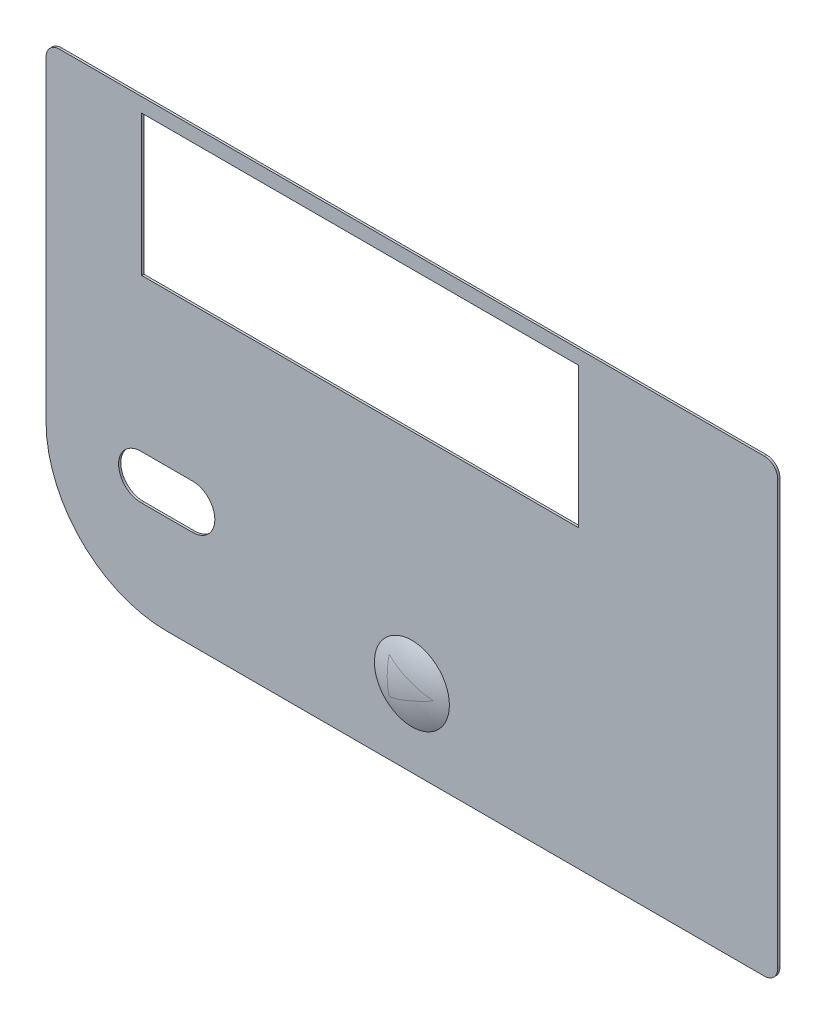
ISO-10303-21;
HEADER;
FILE_DESCRIPTION(('STEP AP214'),'2;1');
FILE_NAME('part.step','',(''),(''),'','','');
FILE_SCHEMA(('AUTOMOTIVE_DESIGN { 1 0 10303 214 1 1 1 1 }'));
ENDSEC;
DATA;
#1=APPLICATION_CONTEXT('core data for automotive mechanical design processes');
#2=APPLICATION_PROTOCOL_DEFINITION('international standard','automotive_design',2000,#1);
#3=PRODUCT_CONTEXT('',#1,'mechanical');
#4=PRODUCT('Part','Part','',(#3));
#5=PRODUCT_RELATED_PRODUCT_CATEGORY('part','',(#4));
#6=PRODUCT_DEFINITION_FORMATION('','',#4);
#7=PRODUCT_DEFINITION_CONTEXT('part definition',#1,'design');
#8=PRODUCT_DEFINITION('design','',#6,#7);
#9=PRODUCT_DEFINITION_SHAPE('','',#8);
#10=(LENGTH_UNIT() NAMED_UNIT(*) SI_UNIT(.MILLI.,.METRE.));
#11=(NAMED_UNIT(*) PLANE_ANGLE_UNIT() SI_UNIT($,.RADIAN.));
#12=(NAMED_UNIT(*) SI_UNIT($,.STERADIAN.) SOLID_ANGLE_UNIT());
#13=UNCERTAINTY_MEASURE_WITH_UNIT(LENGTH_MEASURE(1.E-05),#10,'distance_accuracy_value','');
#14=(GEOMETRIC_REPRESENTATION_CONTEXT(3) GLOBAL_UNCERTAINTY_ASSIGNED_CONTEXT((#13)) GLOBAL_UNIT_ASSIGNED_CONTEXT((#10,
#11,#12)) REPRESENTATION_CONTEXT('',''));
#15=CARTESIAN_POINT('',(0.,0.,0.));
#16=DIRECTION('',(0.,0.,1.));
#17=DIRECTION('',(1.,0.,0.));
#18=AXIS2_PLACEMENT_3D('',#15,#16,#17);
#19=CARTESIAN_POINT('',(0.,-20.,-11.2087121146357));
#20=DIRECTION('',(0.,0.,-1.));
#21=DIRECTION('',(0.,1.,0.));
#22=AXIS2_PLACEMENT_3D('',#19,#20,#21);
#23=SPHERICAL_SURFACE('',#22,12.);
#24=CARTESIAN_POINT('',(0.,-20.,-0.299999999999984));
#25=DIRECTION('',(0.,0.,-1.));
#26=DIRECTION('',(0.,1.,0.));
#27=AXIS2_PLACEMENT_3D('',#24,#25,#26);
#28=CIRCLE('',#27,5.);
#29=CARTESIAN_POINT('',(0.,-15.,-0.3));
#30=VERTEX_POINT('',#29);
#31=EDGE_CURVE('E11',#30,#30,#28,.T.);
#32=ORIENTED_EDGE('',*,*,#31,.F.);
#33=EDGE_LOOP('',(#32));
#34=FACE_BOUND('',#33,.T.);
#35=ADVANCED_FACE('F45',(#34),#23,.T.);
#36=CARTESIAN_POINT('',(0.,-15.,-0.300000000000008));
#37=DIRECTION('',(0.,0.,-1.));
#38=DIRECTION('',(0.,1.,0.));
#39=AXIS2_PLACEMENT_3D('',#36,#37,#38);
#40=PLANE('',#39);
#41=ORIENTED_EDGE('',*,*,#31,.T.);
#42=EDGE_LOOP('',(#41));
#43=FACE_BOUND('',#42,.T.);
#44=ADVANCED_FACE('F52',(#43),#40,.T.);
#45=CLOSED_SHELL('',(#35,#44));
#46=MANIFOLD_SOLID_BREP('B2_NOT_SHOWN',#45);
#47=CARTESIAN_POINT('',(0.,-20.,-11.2087121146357));
#48=DIRECTION('',(0.,0.,-1.));
#49=DIRECTION('',(0.,1.,0.));
#50=AXIS2_PLACEMENT_3D('',#47,#48,#49);
#51=SPHERICAL_SURFACE('',#50,12.3);
#52=CARTESIAN_POINT('',(0.,-20.,0.));
#53=DIRECTION('',(0.,0.,1.));
#54=DIRECTION('',(1.,0.,0.));
#55=AXIS2_PLACEMENT_3D('',#52,#53,#54);
#56=CIRCLE('',#55,5.06505406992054);
#57=CARTESIAN_POINT('',(5.06505406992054,-20.,0.));
#58=VERTEX_POINT('',#57);
#59=EDGE_CURVE('E327',#58,#58,#56,.T.);
#60=ORIENTED_EDGE('',*,*,#59,.T.);
#61=EDGE_LOOP('',(#60));
#62=FACE_BOUND('',#61,.T.);
#63=CARTESIAN_POINT('',(0.512563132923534,-18.7625631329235,-11.2087121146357));
#64=DIRECTION('',(-0.382683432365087,-0.923879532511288,0.));
#65=DIRECTION('',(0.923879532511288,-0.382683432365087,0.));
#66=AXIS2_PLACEMENT_3D('',#63,#64,#65);
#67=CIRCLE('',#66,12.2268568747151);
#68=CARTESIAN_POINT('',(-2.5,-17.5147186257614,0.575318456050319));
#69=VERTEX_POINT('',#68);
#70=CARTESIAN_POINT('',(3.5,-20.,0.582810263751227));
#71=VERTEX_POINT('',#70);
#72=EDGE_CURVE('E80',#69,#71,#67,.F.);
#73=ORIENTED_EDGE('',*,*,#72,.T.);
#74=CARTESIAN_POINT('',(0.512563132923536,-21.2374368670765,-11.2087121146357));
#75=DIRECTION('',(-0.382683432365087,0.923879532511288,0.));
#76=DIRECTION('',(-0.923879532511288,-0.382683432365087,0.));
#77=AXIS2_PLACEMENT_3D('',#74,#75,#76);
#78=CIRCLE('',#77,12.2268568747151);
#79=CARTESIAN_POINT('',(-2.5,-22.4852813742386,0.575318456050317));
#80=VERTEX_POINT('',#79);
#81=EDGE_CURVE('E43',#71,#80,#78,.F.);
#82=ORIENTED_EDGE('',*,*,#81,.T.);
#83=CARTESIAN_POINT('',(-2.5,-20.,-11.2087121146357));
#84=DIRECTION('',(1.,0.,0.));
#85=DIRECTION('',(0.,1.,0.));
#86=AXIS2_PLACEMENT_3D('',#83,#84,#85);
#87=CIRCLE('',#86,12.0432553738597);
#88=EDGE_CURVE('E330',#80,#69,#87,.F.);
#89=ORIENTED_EDGE('',*,*,#88,.T.);
#90=EDGE_LOOP('',(#73,#82,#89));
#91=FACE_BOUND('',#90,.T.);
#92=ADVANCED_FACE('F71',(#62,#91),#51,.T.);
#93=CARTESIAN_POINT('',(-47.625,28.625,-0.3));
#94=DIRECTION('',(0.,0.,1.));
#95=DIRECTION('',(1.,0.,0.));
#96=AXIS2_PLACEMENT_3D('',#93,#94,#95);
#97=PLANE('',#96);
#98=CARTESIAN_POINT('',(-47.625,28.625,-0.3));
#99=DIRECTION('',(0.,0.,1.));
#100=DIRECTION('',(1.,0.,0.));
#101=AXIS2_PLACEMENT_3D('',#98,#99,#100);
#102=CIRCLE('',#101,1.8);
#103=CARTESIAN_POINT('',(-47.625,30.425,-0.3));
#104=VERTEX_POINT('',#103);
#105=CARTESIAN_POINT('',(-49.425,28.625,-0.3));
#106=VERTEX_POINT('',#105);
#107=EDGE_CURVE('E257',#104,#106,#102,.T.);
#108=ORIENTED_EDGE('',*,*,#107,.F.);
#109=DIRECTION('',(-1.,0.,0.));
#110=VECTOR('',#109,1.);
#111=CARTESIAN_POINT('',(-47.625,30.425,-0.3));
#112=LINE('',#111,#110);
#113=CARTESIAN_POINT('',(47.625,30.425,-0.3));
#114=VERTEX_POINT('',#113);
#115=EDGE_CURVE('E279',#114,#104,#112,.T.);
#116=ORIENTED_EDGE('',*,*,#115,.F.);
#117=CARTESIAN_POINT('',(47.625,28.625,-0.3));
#118=DIRECTION('',(0.,0.,1.));
#119=DIRECTION('',(-1.,0.,0.));
#120=AXIS2_PLACEMENT_3D('',#117,#118,#119);
#121=CIRCLE('',#120,1.8);
#122=CARTESIAN_POINT('',(49.425,28.625,-0.3));
#123=VERTEX_POINT('',#122);
#124=EDGE_CURVE('E276',#123,#114,#121,.T.);
#125=ORIENTED_EDGE('',*,*,#124,.F.);
#126=DIRECTION('',(0.,1.,0.));
#127=VECTOR('',#126,1.);
#128=CARTESIAN_POINT('',(49.425,28.625,-0.3));
#129=LINE('',#128,#127);
#130=CARTESIAN_POINT('',(49.425,-28.625,-0.3));
#131=VERTEX_POINT('',#130);
#132=EDGE_CURVE('E273',#131,#123,#129,.T.);
#133=ORIENTED_EDGE('',*,*,#132,.F.);
#134=CARTESIAN_POINT('',(47.625,-28.625,-0.3));
#135=DIRECTION('',(0.,0.,1.));
#136=DIRECTION('',(1.,0.,0.));
#137=AXIS2_PLACEMENT_3D('',#134,#135,#136);
#138=CIRCLE('',#137,1.8);
#139=CARTESIAN_POINT('',(47.625,-30.425,-0.3));
#140=VERTEX_POINT('',#139);
#141=EDGE_CURVE('E270',#140,#131,#138,.T.);
#142=ORIENTED_EDGE('',*,*,#141,.F.);
#143=DIRECTION('',(1.,0.,0.));
#144=VECTOR('',#143,1.);
#145=CARTESIAN_POINT('',(-33.125,-30.425,-0.3));
#146=LINE('',#145,#144);
#147=CARTESIAN_POINT('',(-33.125,-30.425,-0.3));
#148=VERTEX_POINT('',#147);
#149=EDGE_CURVE('E267',#148,#140,#146,.T.);
#150=ORIENTED_EDGE('',*,*,#149,.F.);
#151=CARTESIAN_POINT('',(-33.125,-14.125,-0.3));
#152=DIRECTION('',(0.,0.,1.));
#153=DIRECTION('',(1.,0.,0.));
#154=AXIS2_PLACEMENT_3D('',#151,#152,#153);
#155=CIRCLE('',#154,16.3);
#156=CARTESIAN_POINT('',(-49.425,-14.125,-0.3));
#157=VERTEX_POINT('',#156);
#158=EDGE_CURVE('E264',#157,#148,#155,.T.);
#159=ORIENTED_EDGE('',*,*,#158,.F.);
#160=DIRECTION('',(0.,-1.,0.));
#161=VECTOR('',#160,1.);
#162=CARTESIAN_POINT('',(-49.425,28.625,-0.3));
#163=LINE('',#162,#161);
#164=EDGE_CURVE('E260',#106,#157,#163,.T.);
#165=ORIENTED_EDGE('',*,*,#164,.F.);
#166=EDGE_LOOP('',(#108,#116,#125,#133,#142,#150,#159,#165));
#167=FACE_BOUND('',#166,.T.);
#168=DIRECTION('',(-1.,0.,0.));
#169=VECTOR('',#168,1.);
#170=CARTESIAN_POINT('',(-47.625,-11.1247769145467,-0.3));
#171=LINE('',#170,#169);
#172=CARTESIAN_POINT('',(-29.6250000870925,-11.1247769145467,-0.3));
#173=VERTEX_POINT('',#172);
#174=CARTESIAN_POINT('',(-36.6249999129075,-11.1247769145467,-0.3));
#175=VERTEX_POINT('',#174);
#176=EDGE_CURVE('E250',#173,#175,#171,.T.);
#177=ORIENTED_EDGE('',*,*,#176,.T.);
#178=CARTESIAN_POINT('',(-36.6249999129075,-14.1263385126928,-0.3));
#179=DIRECTION('',(0.,0.,1.));
#180=DIRECTION('',(1.,0.,0.));
#181=AXIS2_PLACEMENT_3D('',#178,#179,#180);
#182=CIRCLE('',#181,3.00156159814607);
#183=CARTESIAN_POINT('',(-36.4881087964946,-17.1247769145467,-0.3));
#184=VERTEX_POINT('',#183);
#185=EDGE_CURVE('E253',#175,#184,#182,.T.);
#186=ORIENTED_EDGE('',*,*,#185,.T.);
#187=DIRECTION('',(1.,0.,0.));
#188=VECTOR('',#187,1.);
#189=CARTESIAN_POINT('',(-47.625,-17.1247769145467,-0.3));
#190=LINE('',#189,#188);
#191=CARTESIAN_POINT('',(-29.6250000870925,-17.1247769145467,-0.3));
#192=VERTEX_POINT('',#191);
#193=EDGE_CURVE('E238',#184,#192,#190,.T.);
#194=ORIENTED_EDGE('',*,*,#193,.T.);
#195=CARTESIAN_POINT('',(-29.6250000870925,-14.1247769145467,-0.3));
#196=DIRECTION('',(0.,0.,1.));
#197=DIRECTION('',(1.,0.,0.));
#198=AXIS2_PLACEMENT_3D('',#195,#196,#197);
#199=CIRCLE('',#198,3.);
#200=EDGE_CURVE('E247',#192,#173,#199,.T.);
#201=ORIENTED_EDGE('',*,*,#200,.T.);
#202=EDGE_LOOP('',(#177,#186,#194,#201));
#203=FACE_BOUND('',#202,.T.);
#204=DIRECTION('',(0.,1.,0.));
#205=VECTOR('',#204,1.);
#206=CARTESIAN_POINT('',(-36.5,28.5,-0.3));
#207=LINE('',#206,#205);
#208=CARTESIAN_POINT('',(-36.5,9.50000000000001,-0.3));
#209=VERTEX_POINT('',#208);
#210=CARTESIAN_POINT('',(-36.5,28.5,-0.3));
#211=VERTEX_POINT('',#210);
#212=EDGE_CURVE('E205',#209,#211,#207,.T.);
#213=ORIENTED_EDGE('',*,*,#212,.F.);
#214=DIRECTION('',(-1.,0.,0.));
#215=VECTOR('',#214,1.);
#216=CARTESIAN_POINT('',(-36.5,9.5,-0.3));
#217=LINE('',#216,#215);
#218=CARTESIAN_POINT('',(22.5,9.5,-0.3));
#219=VERTEX_POINT('',#218);
#220=EDGE_CURVE('E210',#219,#209,#217,.T.);
#221=ORIENTED_EDGE('',*,*,#220,.F.);
#222=DIRECTION('',(0.,-1.,0.));
#223=VECTOR('',#222,1.);
#224=CARTESIAN_POINT('',(22.5,9.5,-0.3));
#225=LINE('',#224,#223);
#226=CARTESIAN_POINT('',(22.5,28.5,-0.3));
#227=VERTEX_POINT('',#226);
#228=EDGE_CURVE('E215',#227,#219,#225,.T.);
#229=ORIENTED_EDGE('',*,*,#228,.F.);
#230=DIRECTION('',(1.,0.,0.));
#231=VECTOR('',#230,1.);
#232=CARTESIAN_POINT('',(22.5,28.5,-0.3));
#233=LINE('',#232,#231);
#234=EDGE_CURVE('E194',#211,#227,#233,.T.);
#235=ORIENTED_EDGE('',*,*,#234,.F.);
#236=EDGE_LOOP('',(#213,#221,#229,#235));
#237=FACE_BOUND('',#236,.T.);
#238=CARTESIAN_POINT('',(0.,-20.,-0.299999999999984));
#239=DIRECTION('',(0.,0.,-1.));
#240=DIRECTION('',(0.,1.,0.));
#241=AXIS2_PLACEMENT_3D('',#238,#239,#240);
#242=CIRCLE('',#241,5.);
#243=CARTESIAN_POINT('',(0.,-15.,-0.3));
#244=VERTEX_POINT('',#243);
#245=EDGE_CURVE('E568',#244,#244,#242,.T.);
#246=ORIENTED_EDGE('',*,*,#245,.F.);
#247=EDGE_LOOP('',(#246));
#248=FACE_BOUND('',#247,.T.);
#249=ADVANCED_FACE('F212',(#167,#203,#237,#248),#97,.F.);
#250=CARTESIAN_POINT('',(-47.625,28.625,-0.3));
#251=DIRECTION('',(0.,0.,1.));
#252=DIRECTION('',(1.,0.,0.));
#253=AXIS2_PLACEMENT_3D('',#250,#251,#252);
#254=CYLINDRICAL_SURFACE('',#253,1.8);
#255=CARTESIAN_POINT('',(-47.625,28.625,0.));
#256=DIRECTION('',(0.,0.,1.));
#257=DIRECTION('',(1.,0.,0.));
#258=AXIS2_PLACEMENT_3D('',#255,#256,#257);
#259=CIRCLE('',#258,1.8);
#260=CARTESIAN_POINT('',(-47.625,30.425,0.));
#261=VERTEX_POINT('',#260);
#262=CARTESIAN_POINT('',(-49.425,28.625,0.));
#263=VERTEX_POINT('',#262);
#264=EDGE_CURVE('E256',#261,#263,#259,.T.);
#265=ORIENTED_EDGE('',*,*,#264,.F.);
#266=DIRECTION('',(0.,0.,1.));
#267=VECTOR('',#266,1.);
#268=CARTESIAN_POINT('',(-47.625,30.425,-0.3));
#269=LINE('',#268,#267);
#270=EDGE_CURVE('E305',#104,#261,#269,.T.);
#271=ORIENTED_EDGE('',*,*,#270,.F.);
#272=ORIENTED_EDGE('',*,*,#107,.T.);
#273=DIRECTION('',(0.,0.,1.));
#274=VECTOR('',#273,1.);
#275=CARTESIAN_POINT('',(-49.425,28.625,-0.3));
#276=LINE('',#275,#274);
#277=EDGE_CURVE('E282',#106,#263,#276,.T.);
#278=ORIENTED_EDGE('',*,*,#277,.T.);
#279=EDGE_LOOP('',(#265,#271,#272,#278));
#280=FACE_BOUND('',#279,.T.);
#281=ADVANCED_FACE('F73',(#280),#254,.T.);
#282=CARTESIAN_POINT('',(-47.625,30.425,-0.3));
#283=DIRECTION('',(0.,1.,0.));
#284=DIRECTION('',(0.,0.,1.));
#285=AXIS2_PLACEMENT_3D('',#282,#283,#284);
#286=PLANE('',#285);
#287=DIRECTION('',(-1.,0.,0.));
#288=VECTOR('',#287,1.);
#289=CARTESIAN_POINT('',(-47.625,30.425,0.));
#290=LINE('',#289,#288);
#291=CARTESIAN_POINT('',(47.625,30.425,0.));
#292=VERTEX_POINT('',#291);
#293=EDGE_CURVE('E261',#292,#261,#290,.T.);
#294=ORIENTED_EDGE('',*,*,#293,.F.);
#295=DIRECTION('',(0.,0.,1.));
#296=VECTOR('',#295,1.);
#297=CARTESIAN_POINT('',(47.625,30.425,-0.3));
#298=LINE('',#297,#296);
#299=EDGE_CURVE('E308',#114,#292,#298,.T.);
#300=ORIENTED_EDGE('',*,*,#299,.F.);
#301=ORIENTED_EDGE('',*,*,#115,.T.);
#302=ORIENTED_EDGE('',*,*,#270,.T.);
#303=EDGE_LOOP('',(#294,#300,#301,#302));
#304=FACE_BOUND('',#303,.T.);
#305=ADVANCED_FACE('F396',(#304),#286,.T.);
#306=CARTESIAN_POINT('',(47.625,28.625,-0.3));
#307=DIRECTION('',(0.,0.,1.));
#308=DIRECTION('',(1.,0.,0.));
#309=AXIS2_PLACEMENT_3D('',#306,#307,#308);
#310=CYLINDRICAL_SURFACE('',#309,1.8);
#311=CARTESIAN_POINT('',(47.625,28.625,0.));
#312=DIRECTION('',(0.,0.,1.));
#313=DIRECTION('',(-1.,0.,0.));
#314=AXIS2_PLACEMENT_3D('',#311,#312,#313);
#315=CIRCLE('',#314,1.8);
#316=CARTESIAN_POINT('',(49.425,28.625,0.));
#317=VERTEX_POINT('',#316);
#318=EDGE_CURVE('E300',#317,#292,#315,.T.);
#319=ORIENTED_EDGE('',*,*,#318,.F.);
#320=DIRECTION('',(0.,0.,1.));
#321=VECTOR('',#320,1.);
#322=CARTESIAN_POINT('',(49.425,28.625,-0.3));
#323=LINE('',#322,#321);
#324=EDGE_CURVE('E310',#123,#317,#323,.T.);
#325=ORIENTED_EDGE('',*,*,#324,.F.);
#326=ORIENTED_EDGE('',*,*,#124,.T.);
#327=ORIENTED_EDGE('',*,*,#299,.T.);
#328=EDGE_LOOP('',(#319,#325,#326,#327));
#329=FACE_BOUND('',#328,.T.);
#330=ADVANCED_FACE('F400',(#329),#310,.T.);
#331=CARTESIAN_POINT('',(49.425,28.625,-0.3));
#332=DIRECTION('',(1.,0.,0.));
#333=DIRECTION('',(0.,0.,-1.));
#334=AXIS2_PLACEMENT_3D('',#331,#332,#333);
#335=PLANE('',#334);
#336=DIRECTION('',(0.,1.,0.));
#337=VECTOR('',#336,1.);
#338=CARTESIAN_POINT('',(49.425,28.625,0.));
#339=LINE('',#338,#337);
#340=CARTESIAN_POINT('',(49.425,-28.625,0.));
#341=VERTEX_POINT('',#340);
#342=EDGE_CURVE('E297',#341,#317,#339,.T.);
#343=ORIENTED_EDGE('',*,*,#342,.F.);
#344=DIRECTION('',(0.,0.,1.));
#345=VECTOR('',#344,1.);
#346=CARTESIAN_POINT('',(49.425,-28.625,-0.3));
#347=LINE('',#346,#345);
#348=EDGE_CURVE('E312',#131,#341,#347,.T.);
#349=ORIENTED_EDGE('',*,*,#348,.F.);
#350=ORIENTED_EDGE('',*,*,#132,.T.);
#351=ORIENTED_EDGE('',*,*,#324,.T.);
#352=EDGE_LOOP('',(#343,#349,#350,#351));
#353=FACE_BOUND('',#352,.T.);
#354=ADVANCED_FACE('F392',(#353),#335,.T.);
#355=CARTESIAN_POINT('',(47.625,-28.625,-0.3));
#356=DIRECTION('',(0.,0.,1.));
#357=DIRECTION('',(1.,0.,0.));
#358=AXIS2_PLACEMENT_3D('',#355,#356,#357);
#359=CYLINDRICAL_SURFACE('',#358,1.8);
#360=CARTESIAN_POINT('',(47.625,-28.625,0.));
#361=DIRECTION('',(0.,0.,1.));
#362=DIRECTION('',(1.,0.,0.));
#363=AXIS2_PLACEMENT_3D('',#360,#361,#362);
#364=CIRCLE('',#363,1.8);
#365=CARTESIAN_POINT('',(47.625,-30.425,0.));
#366=VERTEX_POINT('',#365);
#367=EDGE_CURVE('E294',#366,#341,#364,.T.);
#368=ORIENTED_EDGE('',*,*,#367,.F.);
#369=DIRECTION('',(0.,0.,1.));
#370=VECTOR('',#369,1.);
#371=CARTESIAN_POINT('',(47.625,-30.425,-0.3));
#372=LINE('',#371,#370);
#373=EDGE_CURVE('E314',#140,#366,#372,.T.);
#374=ORIENTED_EDGE('',*,*,#373,.F.);
#375=ORIENTED_EDGE('',*,*,#141,.T.);
#376=ORIENTED_EDGE('',*,*,#348,.T.);
#377=EDGE_LOOP('',(#368,#374,#375,#376));
#378=FACE_BOUND('',#377,.T.);
#379=ADVANCED_FACE('F388',(#378),#359,.T.);
#380=CARTESIAN_POINT('',(-33.125,-30.425,-0.3));
#381=DIRECTION('',(0.,-1.,0.));
#382=DIRECTION('',(0.,0.,-1.));
#383=AXIS2_PLACEMENT_3D('',#380,#381,#382);
#384=PLANE('',#383);
#385=DIRECTION('',(1.,0.,0.));
#386=VECTOR('',#385,1.);
#387=CARTESIAN_POINT('',(-33.125,-30.425,0.));
#388=LINE('',#387,#386);
#389=CARTESIAN_POINT('',(-33.125,-30.425,0.));
#390=VERTEX_POINT('',#389);
#391=EDGE_CURVE('E291',#390,#366,#388,.T.);
#392=ORIENTED_EDGE('',*,*,#391,.F.);
#393=DIRECTION('',(0.,0.,1.));
#394=VECTOR('',#393,1.);
#395=CARTESIAN_POINT('',(-33.125,-30.425,-0.3));
#396=LINE('',#395,#394);
#397=EDGE_CURVE('E316',#148,#390,#396,.T.);
#398=ORIENTED_EDGE('',*,*,#397,.F.);
#399=ORIENTED_EDGE('',*,*,#149,.T.);
#400=ORIENTED_EDGE('',*,*,#373,.T.);
#401=EDGE_LOOP('',(#392,#398,#399,#400));
#402=FACE_BOUND('',#401,.T.);
#403=ADVANCED_FACE('F384',(#402),#384,.T.);
#404=CARTESIAN_POINT('',(-33.125,-14.125,-0.3));
#405=DIRECTION('',(0.,0.,1.));
#406=DIRECTION('',(1.,0.,0.));
#407=AXIS2_PLACEMENT_3D('',#404,#405,#406);
#408=CYLINDRICAL_SURFACE('',#407,16.3);
#409=CARTESIAN_POINT('',(-33.125,-14.125,0.));
#410=DIRECTION('',(0.,0.,1.));
#411=DIRECTION('',(1.,0.,0.));
#412=AXIS2_PLACEMENT_3D('',#409,#410,#411);
#413=CIRCLE('',#412,16.3);
#414=CARTESIAN_POINT('',(-49.425,-14.125,0.));
#415=VERTEX_POINT('',#414);
#416=EDGE_CURVE('E288',#415,#390,#413,.T.);
#417=ORIENTED_EDGE('',*,*,#416,.F.);
#418=DIRECTION('',(0.,0.,1.));
#419=VECTOR('',#418,1.);
#420=CARTESIAN_POINT('',(-49.425,-14.125,-0.3));
#421=LINE('',#420,#419);
#422=EDGE_CURVE('E318',#157,#415,#421,.T.);
#423=ORIENTED_EDGE('',*,*,#422,.F.);
#424=ORIENTED_EDGE('',*,*,#158,.T.);
#425=ORIENTED_EDGE('',*,*,#397,.T.);
#426=EDGE_LOOP('',(#417,#423,#424,#425));
#427=FACE_BOUND('',#426,.T.);
#428=ADVANCED_FACE('F380',(#427),#408,.T.);
#429=CARTESIAN_POINT('',(-49.425,28.625,-0.3));
#430=DIRECTION('',(-1.,0.,0.));
#431=DIRECTION('',(0.,-1.,0.));
#432=AXIS2_PLACEMENT_3D('',#429,#430,#431);
#433=PLANE('',#432);
#434=DIRECTION('',(0.,-1.,0.));
#435=VECTOR('',#434,1.);
#436=CARTESIAN_POINT('',(-49.425,28.625,0.));
#437=LINE('',#436,#435);
#438=EDGE_CURVE('E285',#263,#415,#437,.T.);
#439=ORIENTED_EDGE('',*,*,#438,.F.);
#440=ORIENTED_EDGE('',*,*,#277,.F.);
#441=ORIENTED_EDGE('',*,*,#164,.T.);
#442=ORIENTED_EDGE('',*,*,#422,.T.);
#443=EDGE_LOOP('',(#439,#440,#441,#442));
#444=FACE_BOUND('',#443,.T.);
#445=ADVANCED_FACE('F361',(#444),#433,.T.);
#446=CARTESIAN_POINT('',(-47.625,28.625,0.));
#447=DIRECTION('',(0.,0.,1.));
#448=DIRECTION('',(1.,0.,0.));
#449=AXIS2_PLACEMENT_3D('',#446,#447,#448);
#450=PLANE('',#449);
#451=ORIENTED_EDGE('',*,*,#59,.F.);
#452=EDGE_LOOP('',(#451));
#453=FACE_BOUND('',#452,.T.);
#454=DIRECTION('',(1.,0.,0.));
#455=VECTOR('',#454,1.);
#456=CARTESIAN_POINT('',(-47.625,9.5,0.));
#457=LINE('',#456,#455);
#458=CARTESIAN_POINT('',(-36.5,9.5,0.));
#459=VERTEX_POINT('',#458);
#460=CARTESIAN_POINT('',(22.5,9.5,0.));
#461=VERTEX_POINT('',#460);
#462=EDGE_CURVE('E325',#459,#461,#457,.T.);
#463=ORIENTED_EDGE('',*,*,#462,.F.);
#464=DIRECTION('',(0.,-1.,0.));
#465=VECTOR('',#464,1.);
#466=CARTESIAN_POINT('',(-36.5,28.625,0.));
#467=LINE('',#466,#465);
#468=CARTESIAN_POINT('',(-36.5,28.5,0.));
#469=VERTEX_POINT('',#468);
#470=EDGE_CURVE('E307',#469,#459,#467,.T.);
#471=ORIENTED_EDGE('',*,*,#470,.F.);
#472=DIRECTION('',(-1.,0.,0.));
#473=VECTOR('',#472,1.);
#474=CARTESIAN_POINT('',(-47.625,28.5,0.));
#475=LINE('',#474,#473);
#476=CARTESIAN_POINT('',(22.5,28.5,0.));
#477=VERTEX_POINT('',#476);
#478=EDGE_CURVE('E197',#477,#469,#475,.T.);
#479=ORIENTED_EDGE('',*,*,#478,.F.);
#480=DIRECTION('',(0.,1.,0.));
#481=VECTOR('',#480,1.);
#482=CARTESIAN_POINT('',(22.5,28.625,0.));
#483=LINE('',#482,#481);
#484=EDGE_CURVE('E323',#461,#477,#483,.T.);
#485=ORIENTED_EDGE('',*,*,#484,.F.);
#486=EDGE_LOOP('',(#463,#471,#479,#485));
#487=FACE_BOUND('',#486,.T.);
#488=CARTESIAN_POINT('',(-36.6249999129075,-14.1263385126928,0.));
#489=DIRECTION('',(0.,0.,1.));
#490=DIRECTION('',(1.,0.,0.));
#491=AXIS2_PLACEMENT_3D('',#488,#489,#490);
#492=CIRCLE('',#491,3.00156159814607);
#493=CARTESIAN_POINT('',(-36.6249999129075,-11.1247769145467,0.));
#494=VERTEX_POINT('',#493);
#495=CARTESIAN_POINT('',(-36.4881087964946,-17.1247769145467,0.));
#496=VERTEX_POINT('',#495);
#497=EDGE_CURVE('E222',#494,#496,#492,.T.);
#498=ORIENTED_EDGE('',*,*,#497,.F.);
#499=DIRECTION('',(-1.,0.,0.));
#500=VECTOR('',#499,1.);
#501=CARTESIAN_POINT('',(-36.6249999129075,-11.1247769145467,0.));
#502=LINE('',#501,#500);
#503=CARTESIAN_POINT('',(-29.6250000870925,-11.1247769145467,0.));
#504=VERTEX_POINT('',#503);
#505=EDGE_CURVE('E232',#504,#494,#502,.T.);
#506=ORIENTED_EDGE('',*,*,#505,.F.);
#507=CARTESIAN_POINT('',(-29.6250000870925,-14.1247769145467,0.));
#508=DIRECTION('',(0.,0.,1.));
#509=DIRECTION('',(1.,0.,0.));
#510=AXIS2_PLACEMENT_3D('',#507,#508,#509);
#511=CIRCLE('',#510,3.);
#512=CARTESIAN_POINT('',(-29.6250000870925,-17.1247769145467,0.));
#513=VERTEX_POINT('',#512);
#514=EDGE_CURVE('E229',#513,#504,#511,.T.);
#515=ORIENTED_EDGE('',*,*,#514,.F.);
#516=DIRECTION('',(1.,0.,0.));
#517=VECTOR('',#516,1.);
#518=CARTESIAN_POINT('',(-36.4881087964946,-17.1247769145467,0.));
#519=LINE('',#518,#517);
#520=EDGE_CURVE('E226',#496,#513,#519,.T.);
#521=ORIENTED_EDGE('',*,*,#520,.F.);
#522=EDGE_LOOP('',(#498,#506,#515,#521));
#523=FACE_BOUND('',#522,.T.);
#524=ORIENTED_EDGE('',*,*,#264,.T.);
#525=ORIENTED_EDGE('',*,*,#438,.T.);
#526=ORIENTED_EDGE('',*,*,#416,.T.);
#527=ORIENTED_EDGE('',*,*,#391,.T.);
#528=ORIENTED_EDGE('',*,*,#367,.T.);
#529=ORIENTED_EDGE('',*,*,#342,.T.);
#530=ORIENTED_EDGE('',*,*,#318,.T.);
#531=ORIENTED_EDGE('',*,*,#293,.T.);
#532=EDGE_LOOP('',(#524,#525,#526,#527,#528,#529,#530,#531));
#533=FACE_BOUND('',#532,.T.);
#534=ADVANCED_FACE('F357',(#453,#487,#523,#533),#450,.T.);
#535=CARTESIAN_POINT('',(-36.6249999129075,-14.1263385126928,-10.));
#536=DIRECTION('',(0.,0.,1.));
#537=DIRECTION('',(1.,0.,0.));
#538=AXIS2_PLACEMENT_3D('',#535,#536,#537);
#539=CYLINDRICAL_SURFACE('',#538,3.00156159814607);
#540=DIRECTION('',(0.,0.,1.));
#541=VECTOR('',#540,1.);
#542=CARTESIAN_POINT('',(-36.6249999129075,-11.1247769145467,-10.));
#543=LINE('',#542,#541);
#544=EDGE_CURVE('E236',#175,#494,#543,.T.);
#545=ORIENTED_EDGE('',*,*,#544,.T.);
#546=ORIENTED_EDGE('',*,*,#497,.T.);
#547=DIRECTION('',(0.,0.,1.));
#548=VECTOR('',#547,1.);
#549=CARTESIAN_POINT('',(-36.4881087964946,-17.1247769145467,-10.));
#550=LINE('',#549,#548);
#551=EDGE_CURVE('E235',#184,#496,#550,.T.);
#552=ORIENTED_EDGE('',*,*,#551,.F.);
#553=ORIENTED_EDGE('',*,*,#185,.F.);
#554=EDGE_LOOP('',(#545,#546,#552,#553));
#555=FACE_BOUND('',#554,.T.);
#556=ADVANCED_FACE('F360',(#555),#539,.F.);
#557=CARTESIAN_POINT('',(-36.6249999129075,-11.1247769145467,-10.));
#558=DIRECTION('',(0.,1.,0.));
#559=DIRECTION('',(0.,0.,1.));
#560=AXIS2_PLACEMENT_3D('',#557,#558,#559);
#561=PLANE('',#560);
#562=DIRECTION('',(0.,0.,1.));
#563=VECTOR('',#562,1.);
#564=CARTESIAN_POINT('',(-29.6250000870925,-11.1247769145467,-10.));
#565=LINE('',#564,#563);
#566=EDGE_CURVE('E239',#173,#504,#565,.T.);
#567=ORIENTED_EDGE('',*,*,#566,.T.);
#568=ORIENTED_EDGE('',*,*,#505,.T.);
#569=ORIENTED_EDGE('',*,*,#544,.F.);
#570=ORIENTED_EDGE('',*,*,#176,.F.);
#571=EDGE_LOOP('',(#567,#568,#569,#570));
#572=FACE_BOUND('',#571,.T.);
#573=ADVANCED_FACE('F432',(#572),#561,.F.);
#574=CARTESIAN_POINT('',(-29.6250000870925,-14.1247769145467,-10.));
#575=DIRECTION('',(0.,0.,1.));
#576=DIRECTION('',(1.,0.,0.));
#577=AXIS2_PLACEMENT_3D('',#574,#575,#576);
#578=CYLINDRICAL_SURFACE('',#577,3.);
#579=DIRECTION('',(0.,0.,1.));
#580=VECTOR('',#579,1.);
#581=CARTESIAN_POINT('',(-29.6250000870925,-17.1247769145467,-10.));
#582=LINE('',#581,#580);
#583=EDGE_CURVE('E241',#192,#513,#582,.T.);
#584=ORIENTED_EDGE('',*,*,#583,.T.);
#585=ORIENTED_EDGE('',*,*,#514,.T.);
#586=ORIENTED_EDGE('',*,*,#566,.F.);
#587=ORIENTED_EDGE('',*,*,#200,.F.);
#588=EDGE_LOOP('',(#584,#585,#586,#587));
#589=FACE_BOUND('',#588,.T.);
#590=ADVANCED_FACE('F440',(#589),#578,.F.);
#591=CARTESIAN_POINT('',(-36.4881087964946,-17.1247769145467,-10.));
#592=DIRECTION('',(0.,-1.,0.));
#593=DIRECTION('',(0.,0.,-1.));
#594=AXIS2_PLACEMENT_3D('',#591,#592,#593);
#595=PLANE('',#594);
#596=ORIENTED_EDGE('',*,*,#551,.T.);
#597=ORIENTED_EDGE('',*,*,#520,.T.);
#598=ORIENTED_EDGE('',*,*,#583,.F.);
#599=ORIENTED_EDGE('',*,*,#193,.F.);
#600=EDGE_LOOP('',(#596,#597,#598,#599));
#601=FACE_BOUND('',#600,.T.);
#602=ADVANCED_FACE('F448',(#601),#595,.F.);
#603=CARTESIAN_POINT('',(-36.5,9.5,9.7));
#604=DIRECTION('',(0.,-1.,0.));
#605=DIRECTION('',(1.,0.,0.));
#606=AXIS2_PLACEMENT_3D('',#603,#604,#605);
#607=PLANE('',#606);
#608=ORIENTED_EDGE('',*,*,#462,.T.);
#609=DIRECTION('',(0.,0.,-1.));
#610=VECTOR('',#609,1.);
#611=CARTESIAN_POINT('',(22.5,9.5,9.7));
#612=LINE('',#611,#610);
#613=EDGE_CURVE('E220',#461,#219,#612,.T.);
#614=ORIENTED_EDGE('',*,*,#613,.T.);
#615=ORIENTED_EDGE('',*,*,#220,.T.);
#616=DIRECTION('',(0.,0.,-1.));
#617=VECTOR('',#616,1.);
#618=CARTESIAN_POINT('',(-36.5,9.5,9.7));
#619=LINE('',#618,#617);
#620=EDGE_CURVE('E201',#459,#209,#619,.T.);
#621=ORIENTED_EDGE('',*,*,#620,.F.);
#622=EDGE_LOOP('',(#608,#614,#615,#621));
#623=FACE_BOUND('',#622,.T.);
#624=ADVANCED_FACE('F456',(#623),#607,.F.);
#625=CARTESIAN_POINT('',(22.5,9.5,9.7));
#626=DIRECTION('',(1.,0.,0.));
#627=DIRECTION('',(0.,0.,-1.));
#628=AXIS2_PLACEMENT_3D('',#625,#626,#627);
#629=PLANE('',#628);
#630=ORIENTED_EDGE('',*,*,#484,.T.);
#631=DIRECTION('',(0.,0.,-1.));
#632=VECTOR('',#631,1.);
#633=CARTESIAN_POINT('',(22.5,28.5,9.7));
#634=LINE('',#633,#632);
#635=EDGE_CURVE('E200',#477,#227,#634,.T.);
#636=ORIENTED_EDGE('',*,*,#635,.T.);
#637=ORIENTED_EDGE('',*,*,#228,.T.);
#638=ORIENTED_EDGE('',*,*,#613,.F.);
#639=EDGE_LOOP('',(#630,#636,#637,#638));
#640=FACE_BOUND('',#639,.T.);
#641=ADVANCED_FACE('F464',(#640),#629,.F.);
#642=CARTESIAN_POINT('',(22.5,28.5,9.7));
#643=DIRECTION('',(0.,1.,0.));
#644=DIRECTION('',(-1.,0.,0.));
#645=AXIS2_PLACEMENT_3D('',#642,#643,#644);
#646=PLANE('',#645);
#647=ORIENTED_EDGE('',*,*,#478,.T.);
#648=DIRECTION('',(0.,0.,-1.));
#649=VECTOR('',#648,1.);
#650=CARTESIAN_POINT('',(-36.5,28.5,9.7));
#651=LINE('',#650,#649);
#652=EDGE_CURVE('E189',#469,#211,#651,.T.);
#653=ORIENTED_EDGE('',*,*,#652,.T.);
#654=ORIENTED_EDGE('',*,*,#234,.T.);
#655=ORIENTED_EDGE('',*,*,#635,.F.);
#656=EDGE_LOOP('',(#647,#653,#654,#655));
#657=FACE_BOUND('',#656,.T.);
#658=ADVANCED_FACE('F191',(#657),#646,.F.);
#659=CARTESIAN_POINT('',(-36.5,28.5,9.7));
#660=DIRECTION('',(-1.,0.,0.));
#661=DIRECTION('',(0.,0.,1.));
#662=AXIS2_PLACEMENT_3D('',#659,#660,#661);
#663=PLANE('',#662);
#664=ORIENTED_EDGE('',*,*,#470,.T.);
#665=ORIENTED_EDGE('',*,*,#620,.T.);
#666=ORIENTED_EDGE('',*,*,#212,.T.);
#667=ORIENTED_EDGE('',*,*,#652,.F.);
#668=EDGE_LOOP('',(#664,#665,#666,#667));
#669=FACE_BOUND('',#668,.T.);
#670=ADVANCED_FACE('F206',(#669),#663,.F.);
#671=ORIENTED_EDGE('',*,*,#81,.F.);
#672=ORIENTED_EDGE('',*,*,#72,.F.);
#673=ORIENTED_EDGE('',*,*,#88,.F.);
#674=EDGE_LOOP('',(#671,#672,#673));
#675=FACE_BOUND('',#674,.T.);
#676=ADVANCED_FACE('F336',(#675),#51,.T.);
#677=CARTESIAN_POINT('',(0.,-20.,-11.2087121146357));
#678=DIRECTION('',(0.,0.,-1.));
#679=DIRECTION('',(0.,1.,0.));
#680=AXIS2_PLACEMENT_3D('',#677,#678,#679);
#681=SPHERICAL_SURFACE('',#680,12.);
#682=ORIENTED_EDGE('',*,*,#245,.T.);
#683=EDGE_LOOP('',(#682));
#684=FACE_BOUND('',#683,.T.);
#685=ADVANCED_FACE('F338',(#684),#681,.F.);
#686=CLOSED_SHELL('',(#92,#249,#281,#305,#330,#354,#379,#403,#428,#445,#534,#556,#573,#590,#602,
#624,#641,#658,#670,#676,#685));
#687=MANIFOLD_SOLID_BREP('B6',#686);
#688=ADVANCED_BREP_SHAPE_REPRESENTATION('',(#18,#46,#687),#14);
#689=SHAPE_DEFINITION_REPRESENTATION(#9,#688);
ENDSEC;
END-ISO-10303-21;
